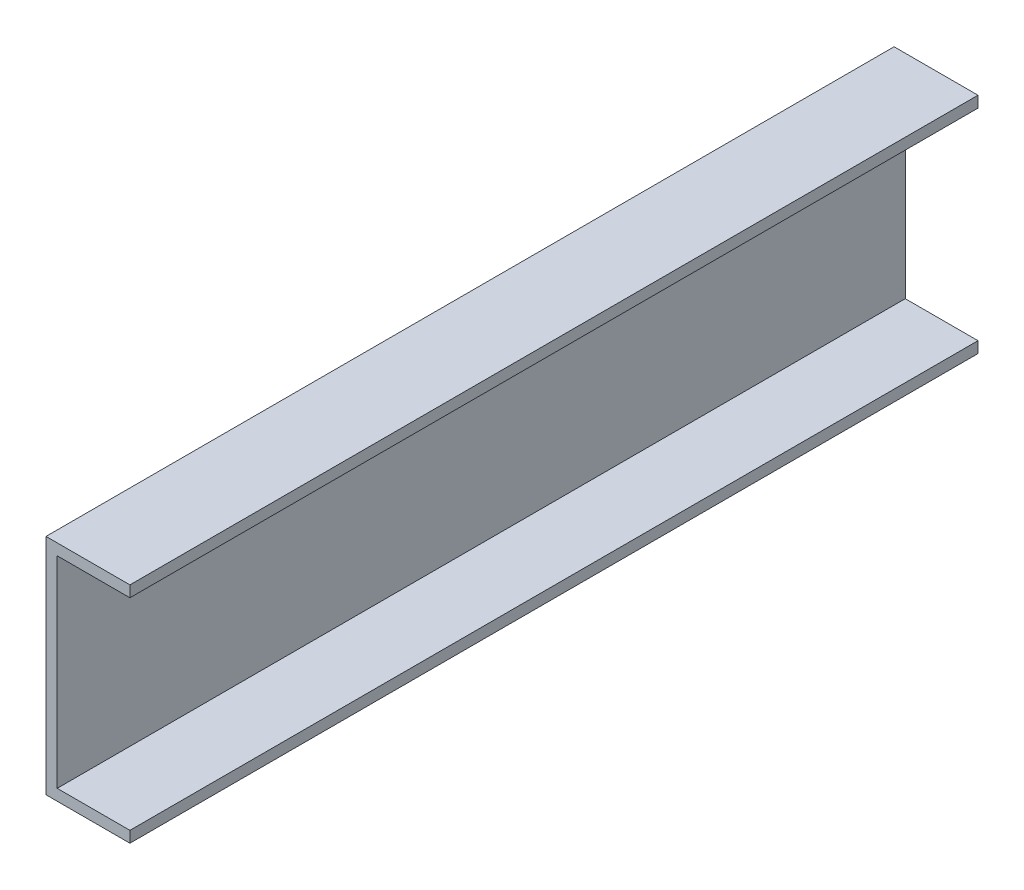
ISO-10303-21;
HEADER;
FILE_DESCRIPTION(('STEP AP214'),'2;1');
FILE_NAME('part.step','',(''),(''),'','','');
FILE_SCHEMA(('AUTOMOTIVE_DESIGN { 1 0 10303 214 1 1 1 1 }'));
ENDSEC;
DATA;
#1=APPLICATION_CONTEXT('core data for automotive mechanical design processes');
#2=APPLICATION_PROTOCOL_DEFINITION('international standard','automotive_design',2000,#1);
#3=PRODUCT_CONTEXT('',#1,'mechanical');
#4=PRODUCT('Part','Part','',(#3));
#5=PRODUCT_RELATED_PRODUCT_CATEGORY('part','',(#4));
#6=PRODUCT_DEFINITION_FORMATION('','',#4);
#7=PRODUCT_DEFINITION_CONTEXT('part definition',#1,'design');
#8=PRODUCT_DEFINITION('design','',#6,#7);
#9=PRODUCT_DEFINITION_SHAPE('','',#8);
#10=(LENGTH_UNIT() NAMED_UNIT(*) SI_UNIT(.MILLI.,.METRE.));
#11=(NAMED_UNIT(*) PLANE_ANGLE_UNIT() SI_UNIT($,.RADIAN.));
#12=(NAMED_UNIT(*) SI_UNIT($,.STERADIAN.) SOLID_ANGLE_UNIT());
#13=UNCERTAINTY_MEASURE_WITH_UNIT(LENGTH_MEASURE(1.E-05),#10,'distance_accuracy_value','');
#14=(GEOMETRIC_REPRESENTATION_CONTEXT(3) GLOBAL_UNCERTAINTY_ASSIGNED_CONTEXT((#13)) GLOBAL_UNIT_ASSIGNED_CONTEXT((#10,
#11,#12)) REPRESENTATION_CONTEXT('',''));
#15=CARTESIAN_POINT('',(0.,0.,0.));
#16=DIRECTION('',(0.,0.,1.));
#17=DIRECTION('',(1.,0.,0.));
#18=AXIS2_PLACEMENT_3D('',#15,#16,#17);
#19=CARTESIAN_POINT('',(75.,9.99999999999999,379.));
#20=DIRECTION('',(-1.,0.,0.));
#21=DIRECTION('',(0.,0.,1.));
#22=AXIS2_PLACEMENT_3D('',#19,#20,#21);
#23=PLANE('',#22);
#24=DIRECTION('',(0.,1.,0.));
#25=VECTOR('',#24,1.);
#26=CARTESIAN_POINT('',(75.,9.99999999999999,-379.));
#27=LINE('',#26,#25);
#28=CARTESIAN_POINT('',(75.,0.,-379.));
#29=VERTEX_POINT('',#28);
#30=CARTESIAN_POINT('',(75.,9.99999999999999,-379.));
#31=VERTEX_POINT('',#30);
#32=EDGE_CURVE('E129',#29,#31,#27,.T.);
#33=ORIENTED_EDGE('',*,*,#32,.T.);
#34=DIRECTION('',(0.,0.,-1.));
#35=VECTOR('',#34,1.);
#36=CARTESIAN_POINT('',(75.,9.99999999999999,379.));
#37=LINE('',#36,#35);
#38=CARTESIAN_POINT('',(75.,9.99999999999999,379.));
#39=VERTEX_POINT('',#38);
#40=EDGE_CURVE('E11',#39,#31,#37,.T.);
#41=ORIENTED_EDGE('',*,*,#40,.F.);
#42=DIRECTION('',(0.,1.,0.));
#43=VECTOR('',#42,1.);
#44=CARTESIAN_POINT('',(75.,9.99999999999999,379.));
#45=LINE('',#44,#43);
#46=CARTESIAN_POINT('',(75.,0.,379.));
#47=VERTEX_POINT('',#46);
#48=EDGE_CURVE('E143',#47,#39,#45,.T.);
#49=ORIENTED_EDGE('',*,*,#48,.F.);
#50=DIRECTION('',(0.,0.,-1.));
#51=VECTOR('',#50,1.);
#52=CARTESIAN_POINT('',(75.,0.,379.));
#53=LINE('',#52,#51);
#54=EDGE_CURVE('E125',#47,#29,#53,.T.);
#55=ORIENTED_EDGE('',*,*,#54,.T.);
#56=EDGE_LOOP('',(#33,#41,#49,#55));
#57=FACE_BOUND('',#56,.T.);
#58=ADVANCED_FACE('F33',(#57),#23,.F.);
#59=CARTESIAN_POINT('',(10.,9.99999999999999,379.));
#60=DIRECTION('',(0.,-1.,0.));
#61=DIRECTION('',(0.,0.,-1.));
#62=AXIS2_PLACEMENT_3D('',#59,#60,#61);
#63=PLANE('',#62);
#64=DIRECTION('',(-1.,0.,0.));
#65=VECTOR('',#64,1.);
#66=CARTESIAN_POINT('',(10.,9.99999999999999,-379.));
#67=LINE('',#66,#65);
#68=CARTESIAN_POINT('',(10.,9.99999999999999,-379.));
#69=VERTEX_POINT('',#68);
#70=EDGE_CURVE('E132',#31,#69,#67,.T.);
#71=ORIENTED_EDGE('',*,*,#70,.T.);
#72=DIRECTION('',(0.,0.,-1.));
#73=VECTOR('',#72,1.);
#74=CARTESIAN_POINT('',(10.,9.99999999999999,379.));
#75=LINE('',#74,#73);
#76=CARTESIAN_POINT('',(10.,9.99999999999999,379.));
#77=VERTEX_POINT('',#76);
#78=EDGE_CURVE('E41',#77,#69,#75,.T.);
#79=ORIENTED_EDGE('',*,*,#78,.F.);
#80=DIRECTION('',(-1.,0.,0.));
#81=VECTOR('',#80,1.);
#82=CARTESIAN_POINT('',(10.,9.99999999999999,379.));
#83=LINE('',#82,#81);
#84=EDGE_CURVE('E92',#39,#77,#83,.T.);
#85=ORIENTED_EDGE('',*,*,#84,.F.);
#86=ORIENTED_EDGE('',*,*,#40,.T.);
#87=EDGE_LOOP('',(#71,#79,#85,#86));
#88=FACE_BOUND('',#87,.T.);
#89=ADVANCED_FACE('F178',(#88),#63,.F.);
#90=CARTESIAN_POINT('',(9.99999999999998,190.,379.));
#91=DIRECTION('',(-1.,0.,0.));
#92=DIRECTION('',(0.,-1.,0.));
#93=AXIS2_PLACEMENT_3D('',#90,#91,#92);
#94=PLANE('',#93);
#95=DIRECTION('',(0.,1.,0.));
#96=VECTOR('',#95,1.);
#97=CARTESIAN_POINT('',(9.99999999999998,190.,-379.));
#98=LINE('',#97,#96);
#99=CARTESIAN_POINT('',(9.99999999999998,190.,-379.));
#100=VERTEX_POINT('',#99);
#101=EDGE_CURVE('E134',#69,#100,#98,.T.);
#102=ORIENTED_EDGE('',*,*,#101,.T.);
#103=DIRECTION('',(0.,0.,-1.));
#104=VECTOR('',#103,1.);
#105=CARTESIAN_POINT('',(9.99999999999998,190.,379.));
#106=LINE('',#105,#104);
#107=CARTESIAN_POINT('',(9.99999999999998,190.,379.));
#108=VERTEX_POINT('',#107);
#109=EDGE_CURVE('E150',#108,#100,#106,.T.);
#110=ORIENTED_EDGE('',*,*,#109,.F.);
#111=DIRECTION('',(0.,1.,0.));
#112=VECTOR('',#111,1.);
#113=CARTESIAN_POINT('',(9.99999999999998,190.,379.));
#114=LINE('',#113,#112);
#115=EDGE_CURVE('E158',#77,#108,#114,.T.);
#116=ORIENTED_EDGE('',*,*,#115,.F.);
#117=ORIENTED_EDGE('',*,*,#78,.T.);
#118=EDGE_LOOP('',(#102,#110,#116,#117));
#119=FACE_BOUND('',#118,.T.);
#120=ADVANCED_FACE('F156',(#119),#94,.F.);
#121=CARTESIAN_POINT('',(75.,190.,379.));
#122=DIRECTION('',(0.,1.,0.));
#123=DIRECTION('',(0.,0.,1.));
#124=AXIS2_PLACEMENT_3D('',#121,#122,#123);
#125=PLANE('',#124);
#126=DIRECTION('',(1.,0.,0.));
#127=VECTOR('',#126,1.);
#128=CARTESIAN_POINT('',(75.,190.,-379.));
#129=LINE('',#128,#127);
#130=CARTESIAN_POINT('',(75.,190.,-379.));
#131=VERTEX_POINT('',#130);
#132=EDGE_CURVE('E136',#100,#131,#129,.T.);
#133=ORIENTED_EDGE('',*,*,#132,.T.);
#134=DIRECTION('',(0.,0.,-1.));
#135=VECTOR('',#134,1.);
#136=CARTESIAN_POINT('',(75.,190.,379.));
#137=LINE('',#136,#135);
#138=CARTESIAN_POINT('',(75.,190.,379.));
#139=VERTEX_POINT('',#138);
#140=EDGE_CURVE('E147',#139,#131,#137,.T.);
#141=ORIENTED_EDGE('',*,*,#140,.F.);
#142=DIRECTION('',(1.,0.,0.));
#143=VECTOR('',#142,1.);
#144=CARTESIAN_POINT('',(75.,190.,379.));
#145=LINE('',#144,#143);
#146=EDGE_CURVE('E170',#108,#139,#145,.T.);
#147=ORIENTED_EDGE('',*,*,#146,.F.);
#148=ORIENTED_EDGE('',*,*,#109,.T.);
#149=EDGE_LOOP('',(#133,#141,#147,#148));
#150=FACE_BOUND('',#149,.T.);
#151=ADVANCED_FACE('F166',(#150),#125,.F.);
#152=CARTESIAN_POINT('',(75.,200.,379.));
#153=DIRECTION('',(-1.,0.,0.));
#154=DIRECTION('',(0.,0.,1.));
#155=AXIS2_PLACEMENT_3D('',#152,#153,#154);
#156=PLANE('',#155);
#157=DIRECTION('',(0.,1.,0.));
#158=VECTOR('',#157,1.);
#159=CARTESIAN_POINT('',(75.,200.,-379.));
#160=LINE('',#159,#158);
#161=CARTESIAN_POINT('',(75.,200.,-379.));
#162=VERTEX_POINT('',#161);
#163=EDGE_CURVE('E138',#131,#162,#160,.T.);
#164=ORIENTED_EDGE('',*,*,#163,.T.);
#165=DIRECTION('',(0.,0.,-1.));
#166=VECTOR('',#165,1.);
#167=CARTESIAN_POINT('',(75.,200.,379.));
#168=LINE('',#167,#166);
#169=CARTESIAN_POINT('',(75.,200.,379.));
#170=VERTEX_POINT('',#169);
#171=EDGE_CURVE('E120',#170,#162,#168,.T.);
#172=ORIENTED_EDGE('',*,*,#171,.F.);
#173=DIRECTION('',(0.,1.,0.));
#174=VECTOR('',#173,1.);
#175=CARTESIAN_POINT('',(75.,200.,379.));
#176=LINE('',#175,#174);
#177=EDGE_CURVE('E111',#139,#170,#176,.T.);
#178=ORIENTED_EDGE('',*,*,#177,.F.);
#179=ORIENTED_EDGE('',*,*,#140,.T.);
#180=EDGE_LOOP('',(#164,#172,#178,#179));
#181=FACE_BOUND('',#180,.T.);
#182=ADVANCED_FACE('F169',(#181),#156,.F.);
#183=CARTESIAN_POINT('',(0.,200.,379.));
#184=DIRECTION('',(0.,-1.,0.));
#185=DIRECTION('',(0.,0.,-1.));
#186=AXIS2_PLACEMENT_3D('',#183,#184,#185);
#187=PLANE('',#186);
#188=DIRECTION('',(-1.,0.,0.));
#189=VECTOR('',#188,1.);
#190=CARTESIAN_POINT('',(0.,200.,-379.));
#191=LINE('',#190,#189);
#192=CARTESIAN_POINT('',(0.,200.,-379.));
#193=VERTEX_POINT('',#192);
#194=EDGE_CURVE('E119',#162,#193,#191,.T.);
#195=ORIENTED_EDGE('',*,*,#194,.T.);
#196=DIRECTION('',(0.,0.,-1.));
#197=VECTOR('',#196,1.);
#198=CARTESIAN_POINT('',(0.,200.,379.));
#199=LINE('',#198,#197);
#200=CARTESIAN_POINT('',(0.,200.,379.));
#201=VERTEX_POINT('',#200);
#202=EDGE_CURVE('E116',#201,#193,#199,.T.);
#203=ORIENTED_EDGE('',*,*,#202,.F.);
#204=DIRECTION('',(-1.,0.,0.));
#205=VECTOR('',#204,1.);
#206=CARTESIAN_POINT('',(0.,200.,379.));
#207=LINE('',#206,#205);
#208=EDGE_CURVE('E105',#170,#201,#207,.T.);
#209=ORIENTED_EDGE('',*,*,#208,.F.);
#210=ORIENTED_EDGE('',*,*,#171,.T.);
#211=EDGE_LOOP('',(#195,#203,#209,#210));
#212=FACE_BOUND('',#211,.T.);
#213=ADVANCED_FACE('F117',(#212),#187,.F.);
#214=CARTESIAN_POINT('',(0.,0.,379.));
#215=DIRECTION('',(1.,0.,0.));
#216=DIRECTION('',(0.,0.,-1.));
#217=AXIS2_PLACEMENT_3D('',#214,#215,#216);
#218=PLANE('',#217);
#219=DIRECTION('',(0.,-1.,0.));
#220=VECTOR('',#219,1.);
#221=CARTESIAN_POINT('',(0.,0.,-379.));
#222=LINE('',#221,#220);
#223=CARTESIAN_POINT('',(0.,0.,-379.));
#224=VERTEX_POINT('',#223);
#225=EDGE_CURVE('E78',#193,#224,#222,.T.);
#226=ORIENTED_EDGE('',*,*,#225,.T.);
#227=DIRECTION('',(0.,0.,-1.));
#228=VECTOR('',#227,1.);
#229=CARTESIAN_POINT('',(0.,0.,379.));
#230=LINE('',#229,#228);
#231=CARTESIAN_POINT('',(0.,0.,379.));
#232=VERTEX_POINT('',#231);
#233=EDGE_CURVE('E121',#232,#224,#230,.T.);
#234=ORIENTED_EDGE('',*,*,#233,.F.);
#235=DIRECTION('',(0.,-1.,0.));
#236=VECTOR('',#235,1.);
#237=CARTESIAN_POINT('',(0.,0.,379.));
#238=LINE('',#237,#236);
#239=EDGE_CURVE('E109',#201,#232,#238,.T.);
#240=ORIENTED_EDGE('',*,*,#239,.F.);
#241=ORIENTED_EDGE('',*,*,#202,.T.);
#242=EDGE_LOOP('',(#226,#234,#240,#241));
#243=FACE_BOUND('',#242,.T.);
#244=ADVANCED_FACE('F123',(#243),#218,.F.);
#245=CARTESIAN_POINT('',(75.,0.,379.));
#246=DIRECTION('',(0.,1.,0.));
#247=DIRECTION('',(-1.,0.,0.));
#248=AXIS2_PLACEMENT_3D('',#245,#246,#247);
#249=PLANE('',#248);
#250=DIRECTION('',(1.,0.,0.));
#251=VECTOR('',#250,1.);
#252=CARTESIAN_POINT('',(75.,0.,-379.));
#253=LINE('',#252,#251);
#254=EDGE_CURVE('E84',#224,#29,#253,.T.);
#255=ORIENTED_EDGE('',*,*,#254,.T.);
#256=ORIENTED_EDGE('',*,*,#54,.F.);
#257=DIRECTION('',(1.,0.,0.));
#258=VECTOR('',#257,1.);
#259=CARTESIAN_POINT('',(75.,0.,379.));
#260=LINE('',#259,#258);
#261=EDGE_CURVE('E49',#232,#47,#260,.T.);
#262=ORIENTED_EDGE('',*,*,#261,.F.);
#263=ORIENTED_EDGE('',*,*,#233,.T.);
#264=EDGE_LOOP('',(#255,#256,#262,#263));
#265=FACE_BOUND('',#264,.T.);
#266=ADVANCED_FACE('F194',(#265),#249,.F.);
#267=CARTESIAN_POINT('',(0.,0.,379.));
#268=DIRECTION('',(0.,0.,-1.));
#269=DIRECTION('',(-1.,0.,0.));
#270=AXIS2_PLACEMENT_3D('',#267,#268,#269);
#271=PLANE('',#270);
#272=ORIENTED_EDGE('',*,*,#48,.T.);
#273=ORIENTED_EDGE('',*,*,#84,.T.);
#274=ORIENTED_EDGE('',*,*,#115,.T.);
#275=ORIENTED_EDGE('',*,*,#146,.T.);
#276=ORIENTED_EDGE('',*,*,#177,.T.);
#277=ORIENTED_EDGE('',*,*,#208,.T.);
#278=ORIENTED_EDGE('',*,*,#239,.T.);
#279=ORIENTED_EDGE('',*,*,#261,.T.);
#280=EDGE_LOOP('',(#272,#273,#274,#275,#276,#277,#278,#279));
#281=FACE_BOUND('',#280,.T.);
#282=ADVANCED_FACE('F107',(#281),#271,.F.);
#283=CARTESIAN_POINT('',(0.,0.,-379.));
#284=DIRECTION('',(0.,0.,-1.));
#285=DIRECTION('',(-1.,0.,0.));
#286=AXIS2_PLACEMENT_3D('',#283,#284,#285);
#287=PLANE('',#286);
#288=ORIENTED_EDGE('',*,*,#32,.F.);
#289=ORIENTED_EDGE('',*,*,#254,.F.);
#290=ORIENTED_EDGE('',*,*,#225,.F.);
#291=ORIENTED_EDGE('',*,*,#194,.F.);
#292=ORIENTED_EDGE('',*,*,#163,.F.);
#293=ORIENTED_EDGE('',*,*,#132,.F.);
#294=ORIENTED_EDGE('',*,*,#101,.F.);
#295=ORIENTED_EDGE('',*,*,#70,.F.);
#296=EDGE_LOOP('',(#288,#289,#290,#291,#292,#293,#294,#295));
#297=FACE_BOUND('',#296,.T.);
#298=ADVANCED_FACE('F162',(#297),#287,.T.);
#299=CLOSED_SHELL('',(#58,#89,#120,#151,#182,#213,#244,#266,#282,#298));
#300=MANIFOLD_SOLID_BREP('B2',#299);
#301=ADVANCED_BREP_SHAPE_REPRESENTATION('',(#18,#300),#14);
#302=SHAPE_DEFINITION_REPRESENTATION(#9,#301);
ENDSEC;
END-ISO-10303-21;
